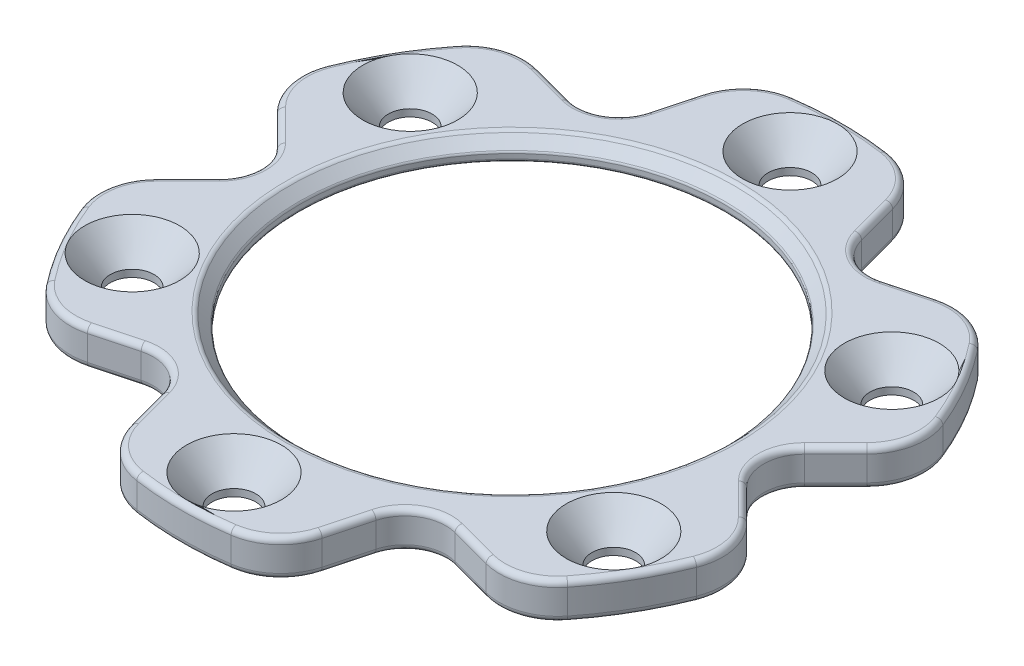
from build123d import *

# Parameters (mm, degrees)
SKETCH1_R                                     = 18.415
BOSS_EXTRUDE1_DEPTH                           = 3.175
CSK_FOR_6_FLAT_HEAD_SOCKET_CAP_SCREW1_A_COUNT = 2
CSK_FOR_6_FLAT_HEAD_SOCKET_CAP_SCREW1_A_PITCH = 48.26
CSK_FOR_6_FLAT_HEAD_SOCKET_CAP_SCRE_2_COUNT   = 2
CSK_FOR_6_FLAT_HEAD_SOCKET_CAP_SCRE_2_PITCH   = 24.13
CSK_FOR_6_FLAT_HEAD_SOCKET_CAP_SCRE_3_COUNT   = 2
CSK_FOR_6_FLAT_HEAD_SOCKET_CAP_SCRE_3_PITCH   = 41.794385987
CSK_FOR_6_FLAT_HEAD_SOCKET_CAP_SCRE_4_COUNT   = 2
CSK_FOR_6_FLAT_HEAD_SOCKET_CAP_SCRE_4_PITCH   = 41.794385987
CSK_FOR_6_FLAT_HEAD_SOCKET_CAP_SCRE_5_COUNT   = 2
CSK_FOR_6_FLAT_HEAD_SOCKET_CAP_SCRE_5_PITCH   = 24.13
CHAMFER1_SIZE                                 = 1.016
CUT_EXTRUDE1_DEPTH                            = 41.804271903
CUT_EXTRUDE1_DEPTH_BACK                       = 1.397
SKETCH4_R                                     = 20.6375
CUT_EXTRUDE2_DEPTH                            = 41.804271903
FILLET9_R                                     = 5.08
FILLET6_R                                     = 0.254
FILLET7_R                                     = 0.508


with BuildPart() as part:
    # Sketch1 → Boss-Extrude1 (new body)
    with BuildSketch(Plane(origin=(0, 0, 0), x_dir=(1, 0, 0), z_dir=(0, 1, 0))):
        with BuildLine():
            ThreePointArc((23.463937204, 16.640241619), (20.340280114, 20.340280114), (16.640241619, 23.463937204))
            ThreePointArc((16.640241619, 23.463937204), (-4.825081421, 28.3579368), (-23.463937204, 16.640241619))
            ThreePointArc((-23.463937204, 16.640241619), (-20.340280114, -20.340280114), (16.640241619, -23.463937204))
            ThreePointArc((16.640241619, -23.463937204), (28.3579368, -4.825081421), (23.463937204, 16.640241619))
        make_face()
        with Locations(Location((0, 0, 0), (0, 0, 270))):
            Circle(SKETCH1_R, mode=Mode.SUBTRACT)
    extrude(amount=BOSS_EXTRUDE1_DEPTH)

    # Sketch3 → CSK for _6 Flat Head Socket Cap Screw1 (revolve, cut)
    with BuildSketch(Plane(origin=(20.897192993, 3.175, -12.065), x_dir=(0, 0, 1), z_dir=(1, 0, 0))):
        Polygon((0, 0), (0, 3.175), (1.89865, 3.175), (1.89865, 2.555013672), (4.1196895, 0), align=None)
    csk_for_6_flat_head_socket_cap_screw1 = revolve(axis=Axis((20.897192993, 9.525, -12.065), (0, -1, 0)), mode=Mode.SUBTRACT)

    # CSK for _6 Flat Head Socket Cap Screw1 a: CSK for _6 Flat Head Socket Cap Screw1 ×2
    with Locations(*[Vector(-0.8660254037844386, 0, 0.5000000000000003) * (i * CSK_FOR_6_FLAT_HEAD_SOCKET_CAP_SCREW1_A_PITCH) for i in range(1, CSK_FOR_6_FLAT_HEAD_SOCKET_CAP_SCREW1_A_COUNT)]):
        add(csk_for_6_flat_head_socket_cap_screw1, mode=Mode.SUBTRACT)

    # CSK for _6 Flat Head Socket Cap Scre 2: CSK for _6 Flat Head Socket Cap Screw1 ×2
    with Locations(*[Vector(-0.8660254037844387, 0, -0.49999999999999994) * (i * CSK_FOR_6_FLAT_HEAD_SOCKET_CAP_SCRE_2_PITCH) for i in range(1, CSK_FOR_6_FLAT_HEAD_SOCKET_CAP_SCRE_2_COUNT)]):
        add(csk_for_6_flat_head_socket_cap_screw1, mode=Mode.SUBTRACT)

    # CSK for _6 Flat Head Socket Cap Scre 3: CSK for _6 Flat Head Socket Cap Screw1 ×2
    with Locations(*[(-i * CSK_FOR_6_FLAT_HEAD_SOCKET_CAP_SCRE_3_PITCH, 0, 0) for i in range(1, CSK_FOR_6_FLAT_HEAD_SOCKET_CAP_SCRE_3_COUNT)]):
        add(csk_for_6_flat_head_socket_cap_screw1, mode=Mode.SUBTRACT)

    # CSK for _6 Flat Head Socket Cap Scre 4: CSK for _6 Flat Head Socket Cap Screw1 ×2
    with Locations(*[Vector(-0.4999999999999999, 0, 0.8660254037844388) * (i * CSK_FOR_6_FLAT_HEAD_SOCKET_CAP_SCRE_4_PITCH) for i in range(1, CSK_FOR_6_FLAT_HEAD_SOCKET_CAP_SCRE_4_COUNT)]):
        add(csk_for_6_flat_head_socket_cap_screw1, mode=Mode.SUBTRACT)

    # CSK for _6 Flat Head Socket Cap Scre 5: CSK for _6 Flat Head Socket Cap Screw1 ×2
    with Locations(*[(0, 0, i * CSK_FOR_6_FLAT_HEAD_SOCKET_CAP_SCRE_5_PITCH) for i in range(1, CSK_FOR_6_FLAT_HEAD_SOCKET_CAP_SCRE_5_COUNT)]):
        add(csk_for_6_flat_head_socket_cap_screw1, mode=Mode.SUBTRACT)

    # Chamfer1
    chamfer1_edges = [part.edges().sort_by_distance(p)[0] for p in [
        (0, 3.175, -18.415),
    ]]
    chamfer(chamfer1_edges, length=CHAMFER1_SIZE)

    # Sketch4 → Cut-Extrude1 (cut, two sides: drawn at the far end of the back side and taken through both)
    with BuildSketch(Plane.XZ.offset(-CUT_EXTRUDE1_DEPTH_BACK)):
        with Locations(Location((0, 0, 0), (0, 0, 90))):
            Circle(SKETCH4_R)
    extrude(amount=CUT_EXTRUDE1_DEPTH + CUT_EXTRUDE1_DEPTH_BACK, mode=Mode.SUBTRACT)

    # Sketch6 → Cut-Extrude2 (cut, through all)
    with BuildSketch(Plane(origin=(0, 3.175, 0), x_dir=(1, 0, 0), z_dir=(0, 1, 0))):
        with BuildLine():
            Line((38.405553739, 18.034497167), (38.11941519, -17.748358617))
            Line((38.11941519, -17.748358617), (22.885528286, -2.514471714))
            ThreePointArc((22.885528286, -2.514471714), (21.844, 0), (22.885528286, 2.514471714))
            Line((22.885528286, 2.514471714), (38.405553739, 18.034497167))
        make_face()
        with BuildLine():
            Line((3.584444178, 42.277433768), (34.430237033, 24.138202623))
            Line((34.430237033, 24.138202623), (13.620360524, 18.562213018))
            ThreePointArc((13.620360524, 18.562213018), (10.922, 18.91745892), (9.265167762, 21.076684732))
            Line((9.265167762, 21.076684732), (3.584444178, 42.277433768))
        make_face()
        with BuildLine():
            Line((34.821109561, -24.242936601), (3.689178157, -41.88656124))
            Line((3.689178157, -41.88656124), (9.265167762, -21.076684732))
            ThreePointArc((9.265167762, -21.076684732), (10.922, -18.91745892), (13.620360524, -18.562213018))
            Line((13.620360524, -18.562213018), (34.821109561, -24.242936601))
        make_face()
        with BuildLine():
            Line((-3.584444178, -42.277433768), (-34.430237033, -24.138202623))
            Line((-34.430237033, -24.138202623), (-13.620360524, -18.562213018))
            ThreePointArc((-13.620360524, -18.562213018), (-10.922, -18.91745892), (-9.265167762, -21.076684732))
            Line((-9.265167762, -21.076684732), (-3.584444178, -42.277433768))
        make_face()
        with BuildLine():
            Line((-38.405553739, -18.034497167), (-38.11941519, 17.748358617))
            Line((-38.11941519, 17.748358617), (-22.885528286, 2.514471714))
            ThreePointArc((-22.885528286, 2.514471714), (-21.844, 0), (-22.885528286, -2.514471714))
            Line((-22.885528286, -2.514471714), (-38.405553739, -18.034497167))
        make_face()
        with BuildLine():
            Line((-34.821109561, 24.242936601), (-3.689178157, 41.88656124))
            Line((-3.689178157, 41.88656124), (-9.265167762, 21.076684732))
            ThreePointArc((-9.265167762, 21.076684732), (-10.922, 18.91745892), (-13.620360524, 18.562213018))
            Line((-13.620360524, 18.562213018), (-34.821109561, 24.242936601))
        make_face()
    extrude(amount=-CUT_EXTRUDE2_DEPTH, mode=Mode.SUBTRACT)

    # Fillet9
    fillet9_edges = [part.edges().sort_by_distance(p)[0] for p in [
        (27.791834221, 1.5875, 7.420777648),
        (27.791834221, 1.5875, -7.420777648),
        (20.32249907, 1.5875, -20.358045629),
        (7.469335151, 1.5875, -27.778823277),
        (-7.469335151, 1.5875, -27.778823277),
        (-20.32249907, 1.5875, -20.358045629),
        (-27.791834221, 1.5875, -7.420777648),
        (-27.791834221, 1.5875, 7.420777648),
        (-20.32249907, 1.5875, 20.358045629),
        (-7.469335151, 1.5875, 27.778823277),
        (7.469335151, 1.5875, 27.778823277),
        (20.32249907, 1.5875, 20.358045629),
    ]]
    fillet(fillet9_edges, radius=FILLET9_R)

    # Fillet6
    fillet6_edges = [part.edges().sort_by_distance(p)[0] for p in [
        (0, 2.159, -18.415),
        (0, 1.397, -20.6375),
        (0, 0, -20.6375),
        (0, 1.397, -18.415),
    ]]
    fillet(fillet6_edges, radius=FILLET6_R)

    # Fillet7
    fillet7_edges = [part.edges().sort_by_distance(p)[0] for p in [
        (8.771816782, 0, 22.917895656),
        (8.771816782, 3.175, 22.917895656),
        (10.922, 3.175, 18.91745892),
        (10.922, 0, 18.91745892),
        (-15.461571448, 0, 19.055563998),
        (-15.461571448, 3.175, 19.055563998),
        (-10.922, 3.175, 18.91745892),
        (-10.922, 0, 18.91745892),
        (-24.23338823, 0, -3.862331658),
        (-24.23338823, 3.175, -3.862331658),
        (-21.844, 3.175, 0),
        (-21.844, 0, 0),
        (-8.771816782, 0, -22.917895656),
        (-8.771816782, 3.175, -22.917895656),
        (-10.922, 3.175, -18.91745892),
        (-10.922, 0, -18.91745892),
        (15.461571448, 0, -19.055563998),
        (15.461571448, 3.175, -19.055563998),
        (10.922, 3.175, -18.91745892),
        (10.922, 0, -18.91745892),
        (24.23338823, 0, 3.862331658),
        (24.23338823, 3.175, 3.862331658),
        (21.844, 3.175, 0),
        (21.844, 0, 0),
        (24.911653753, 0, -14.38275),
        (24.911653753, 3.175, -14.38275),
        (15.461571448, 3.175, 19.055563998),
        (24.911653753, 3.175, 14.38275),
        (24.23338823, 3.175, -3.862331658),
        (8.771816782, 3.175, -22.917895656),
        (0, 3.175, -28.7655),
        (-15.461571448, 3.175, -19.055563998),
        (-25.260429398, 3.175, -13.760984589),
        (-24.23338823, 3.175, 3.862331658),
        (-24.911653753, 3.175, 14.38275),
        (-8.771816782, 3.175, 22.917895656),
        (0, 3.175, 28.7655),
        (-20.221766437, 3.175, -19.462073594),
        (-26.965533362, 3.175, -7.781526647),
        (-26.965533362, 3.175, 7.781526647),
        (20.221766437, 3.175, 19.462073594),
        (6.743766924, 3.175, 27.243600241),
        (26.965533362, 3.175, -7.781526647),
        (26.965533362, 3.175, 7.781526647),
        (-6.743766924, 3.175, 27.243600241),
        (-20.221766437, 3.175, 19.462073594),
        (-6.743766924, 3.175, -27.243600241),
        (6.743766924, 3.175, -27.243600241),
        (20.221766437, 3.175, -19.462073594),
        (24.911653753, 0, 14.38275),
        (15.461571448, 0, 19.055563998),
        (0, 0, 28.7655),
        (-8.771816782, 0, 22.917895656),
        (-24.911653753, 0, 14.38275),
        (-24.23338823, 0, 3.862331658),
        (-25.260429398, 0, -13.760984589),
        (-15.461571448, 0, -19.055563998),
        (0, 0, -28.7655),
        (8.771816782, 0, -22.917895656),
        (24.23338823, 0, -3.862331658),
        (-20.221766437, 0, -19.462073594),
        (-26.965533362, 0, -7.781526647),
        (-26.965533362, 0, 7.781526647),
        (20.221766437, 0, 19.462073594),
        (6.743766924, 0, 27.243600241),
        (26.965533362, 0, -7.781526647),
        (26.965533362, 0, 7.781526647),
        (-6.743766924, 0, 27.243600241),
        (-20.221766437, 0, 19.462073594),
        (-6.743766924, 0, -27.243600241),
        (6.743766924, 0, -27.243600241),
        (20.221766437, 0, -19.462073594),
        (0, 3.175, -19.431),
    ]]
    fillet(fillet7_edges, radius=FILLET7_R)


solid = part.part
